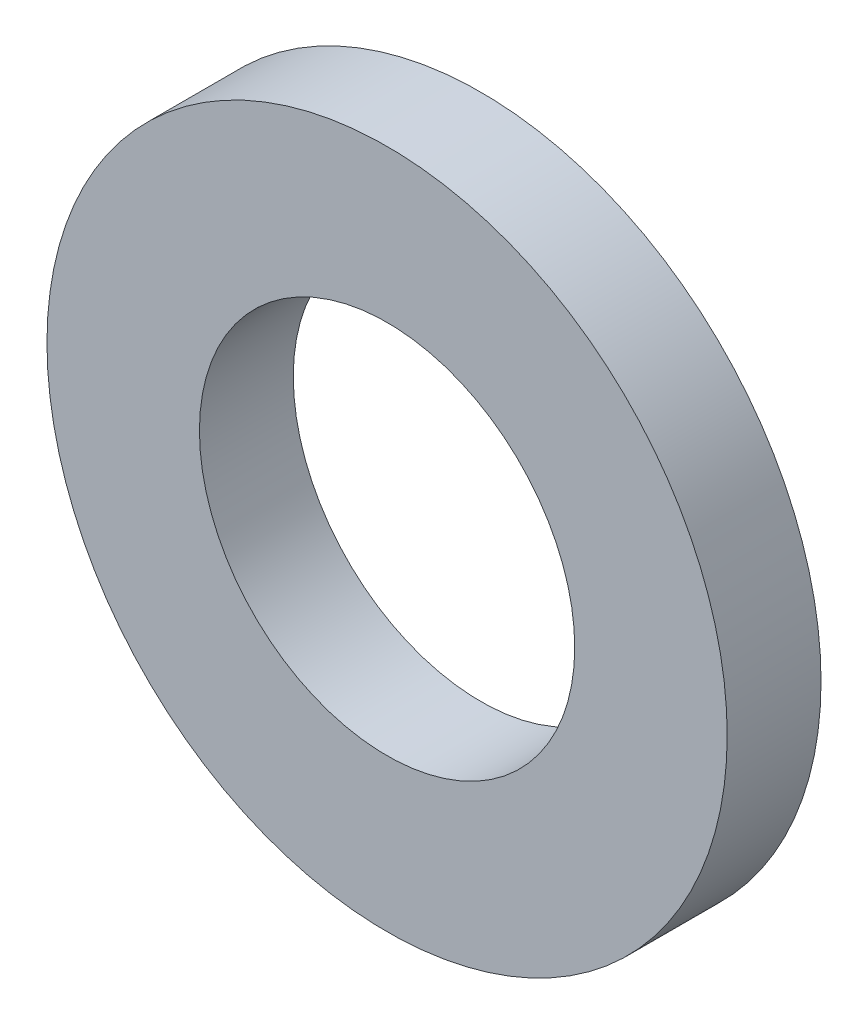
from build123d import *

# Parameters (mm, degrees)
ESQUISSE1_R          = 2.9
ESQUISSE1_R_2        = 1.6
BASE_EXTRUSION_DEPTH = 0.8


with BuildPart() as part:
    # Esquisse1 → Base-Extrusion (new body)
    with BuildSketch(Plane.XY):
        Circle(ESQUISSE1_R)
        Circle(ESQUISSE1_R_2, mode=Mode.SUBTRACT)
    extrude(amount=BASE_EXTRUSION_DEPTH)


solid = part.part
